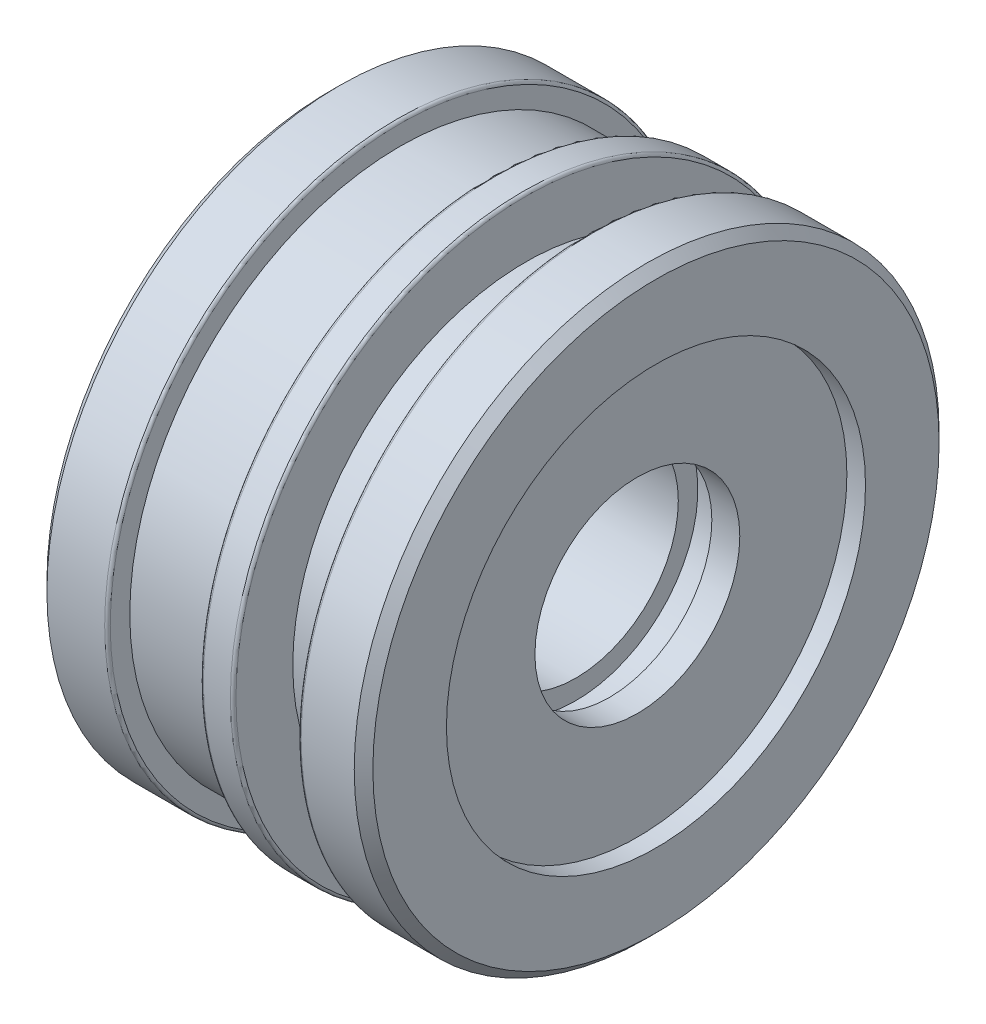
ISO-10303-21;
HEADER;
FILE_DESCRIPTION(('STEP AP214'),'2;1');
FILE_NAME('part.step','',(''),(''),'','','');
FILE_SCHEMA(('AUTOMOTIVE_DESIGN { 1 0 10303 214 1 1 1 1 }'));
ENDSEC;
DATA;
#1=APPLICATION_CONTEXT('core data for automotive mechanical design processes');
#2=APPLICATION_PROTOCOL_DEFINITION('international standard','automotive_design',2000,#1);
#3=PRODUCT_CONTEXT('',#1,'mechanical');
#4=PRODUCT('Part','Part','',(#3));
#5=PRODUCT_RELATED_PRODUCT_CATEGORY('part','',(#4));
#6=PRODUCT_DEFINITION_FORMATION('','',#4);
#7=PRODUCT_DEFINITION_CONTEXT('part definition',#1,'design');
#8=PRODUCT_DEFINITION('design','',#6,#7);
#9=PRODUCT_DEFINITION_SHAPE('','',#8);
#10=(LENGTH_UNIT() NAMED_UNIT(*) SI_UNIT(.MILLI.,.METRE.));
#11=(NAMED_UNIT(*) PLANE_ANGLE_UNIT() SI_UNIT($,.RADIAN.));
#12=(NAMED_UNIT(*) SI_UNIT($,.STERADIAN.) SOLID_ANGLE_UNIT());
#13=UNCERTAINTY_MEASURE_WITH_UNIT(LENGTH_MEASURE(1.E-05),#10,'distance_accuracy_value','');
#14=(GEOMETRIC_REPRESENTATION_CONTEXT(3) GLOBAL_UNCERTAINTY_ASSIGNED_CONTEXT((#13)) GLOBAL_UNIT_ASSIGNED_CONTEXT((#10,
#11,#12)) REPRESENTATION_CONTEXT('',''));
#15=CARTESIAN_POINT('',(0.,0.,0.));
#16=DIRECTION('',(0.,0.,1.));
#17=DIRECTION('',(1.,0.,0.));
#18=AXIS2_PLACEMENT_3D('',#15,#16,#17);
#19=CARTESIAN_POINT('',(0.,0.,0.));
#20=DIRECTION('',(-1.,0.,0.));
#21=DIRECTION('',(0.,0.,1.));
#22=AXIS2_PLACEMENT_3D('',#19,#20,#21);
#23=CYLINDRICAL_SURFACE('',#22,31.4);
#24=CARTESIAN_POINT('',(7.2,0.,0.));
#25=DIRECTION('',(-1.,0.,0.));
#26=DIRECTION('',(0.,0.,1.));
#27=AXIS2_PLACEMENT_3D('',#24,#25,#26);
#28=CIRCLE('',#27,31.4);
#29=CARTESIAN_POINT('',(7.2,0.,31.4));
#30=VERTEX_POINT('',#29);
#31=EDGE_CURVE('E35',#30,#30,#28,.T.);
#32=ORIENTED_EDGE('',*,*,#31,.T.);
#33=EDGE_LOOP('',(#32));
#34=FACE_BOUND('',#33,.T.);
#35=CARTESIAN_POINT('',(1.,0.,0.));
#36=DIRECTION('',(1.,0.,0.));
#37=DIRECTION('',(0.,0.,-1.));
#38=AXIS2_PLACEMENT_3D('',#35,#36,#37);
#39=CIRCLE('',#38,31.4);
#40=CARTESIAN_POINT('',(1.,0.,-31.4));
#41=VERTEX_POINT('',#40);
#42=EDGE_CURVE('E66',#41,#41,#39,.T.);
#43=ORIENTED_EDGE('',*,*,#42,.T.);
#44=EDGE_LOOP('',(#43));
#45=FACE_BOUND('',#44,.T.);
#46=ADVANCED_FACE('F29',(#34,#45),#23,.T.);
#47=CARTESIAN_POINT('',(7.5,31.4,0.));
#48=DIRECTION('',(-1.,0.,0.));
#49=DIRECTION('',(0.,0.,1.));
#50=AXIS2_PLACEMENT_3D('',#47,#48,#49);
#51=PLANE('',#50);
#52=CARTESIAN_POINT('',(7.5,0.,0.));
#53=DIRECTION('',(-1.,0.,0.));
#54=DIRECTION('',(0.,0.,1.));
#55=AXIS2_PLACEMENT_3D('',#52,#53,#54);
#56=CIRCLE('',#55,31.1);
#57=CARTESIAN_POINT('',(7.5,0.,31.1));
#58=VERTEX_POINT('',#57);
#59=EDGE_CURVE('E10',#58,#58,#56,.F.);
#60=ORIENTED_EDGE('',*,*,#59,.T.);
#61=EDGE_LOOP('',(#60));
#62=FACE_BOUND('',#61,.T.);
#63=CARTESIAN_POINT('',(7.5,0.,0.));
#64=DIRECTION('',(-1.,0.,0.));
#65=DIRECTION('',(0.,0.,1.));
#66=AXIS2_PLACEMENT_3D('',#63,#64,#65);
#67=CIRCLE('',#66,29.);
#68=CARTESIAN_POINT('',(7.5,0.,29.));
#69=VERTEX_POINT('',#68);
#70=EDGE_CURVE('E72',#69,#69,#67,.T.);
#71=ORIENTED_EDGE('',*,*,#70,.T.);
#72=EDGE_LOOP('',(#71));
#73=FACE_BOUND('',#72,.T.);
#74=ADVANCED_FACE('F133',(#62,#73),#51,.F.);
#75=CARTESIAN_POINT('',(0.,0.,0.));
#76=DIRECTION('',(-1.,0.,0.));
#77=DIRECTION('',(0.,0.,1.));
#78=AXIS2_PLACEMENT_3D('',#75,#76,#77);
#79=CYLINDRICAL_SURFACE('',#78,29.);
#80=ORIENTED_EDGE('',*,*,#70,.F.);
#81=EDGE_LOOP('',(#80));
#82=FACE_BOUND('',#81,.T.);
#83=CARTESIAN_POINT('',(17.5,0.,0.));
#84=DIRECTION('',(-1.,0.,0.));
#85=DIRECTION('',(0.,0.,1.));
#86=AXIS2_PLACEMENT_3D('',#83,#84,#85);
#87=CIRCLE('',#86,29.);
#88=CARTESIAN_POINT('',(17.5,0.,29.));
#89=VERTEX_POINT('',#88);
#90=EDGE_CURVE('E75',#89,#89,#87,.T.);
#91=ORIENTED_EDGE('',*,*,#90,.T.);
#92=EDGE_LOOP('',(#91));
#93=FACE_BOUND('',#92,.T.);
#94=ADVANCED_FACE('F137',(#82,#93),#79,.T.);
#95=CARTESIAN_POINT('',(17.5,29.,0.));
#96=DIRECTION('',(1.,0.,0.));
#97=DIRECTION('',(0.,0.,-1.));
#98=AXIS2_PLACEMENT_3D('',#95,#96,#97);
#99=PLANE('',#98);
#100=CARTESIAN_POINT('',(17.5,0.,0.));
#101=DIRECTION('',(1.,0.,0.));
#102=DIRECTION('',(0.,0.,-1.));
#103=AXIS2_PLACEMENT_3D('',#100,#101,#102);
#104=CIRCLE('',#103,31.1);
#105=CARTESIAN_POINT('',(17.5,0.,-31.1));
#106=VERTEX_POINT('',#105);
#107=EDGE_CURVE('E57',#106,#106,#104,.F.);
#108=ORIENTED_EDGE('',*,*,#107,.T.);
#109=EDGE_LOOP('',(#108));
#110=FACE_BOUND('',#109,.T.);
#111=ORIENTED_EDGE('',*,*,#90,.F.);
#112=EDGE_LOOP('',(#111));
#113=FACE_BOUND('',#112,.T.);
#114=ADVANCED_FACE('F145',(#110,#113),#99,.F.);
#115=CARTESIAN_POINT('',(0.,0.,0.));
#116=DIRECTION('',(-1.,0.,0.));
#117=DIRECTION('',(0.,0.,1.));
#118=AXIS2_PLACEMENT_3D('',#115,#116,#117);
#119=CYLINDRICAL_SURFACE('',#118,31.4);
#120=CARTESIAN_POINT('',(17.8,0.,0.));
#121=DIRECTION('',(1.,0.,0.));
#122=DIRECTION('',(0.,0.,-1.));
#123=AXIS2_PLACEMENT_3D('',#120,#121,#122);
#124=CIRCLE('',#123,31.4);
#125=CARTESIAN_POINT('',(17.8,0.,-31.4));
#126=VERTEX_POINT('',#125);
#127=EDGE_CURVE('E51',#126,#126,#124,.T.);
#128=ORIENTED_EDGE('',*,*,#127,.T.);
#129=EDGE_LOOP('',(#128));
#130=FACE_BOUND('',#129,.T.);
#131=CARTESIAN_POINT('',(20.7,0.,0.));
#132=DIRECTION('',(-1.,0.,0.));
#133=DIRECTION('',(0.,0.,1.));
#134=AXIS2_PLACEMENT_3D('',#131,#132,#133);
#135=CIRCLE('',#134,31.4);
#136=CARTESIAN_POINT('',(20.7,0.,31.4));
#137=VERTEX_POINT('',#136);
#138=EDGE_CURVE('E54',#137,#137,#135,.T.);
#139=ORIENTED_EDGE('',*,*,#138,.T.);
#140=EDGE_LOOP('',(#139));
#141=FACE_BOUND('',#140,.T.);
#142=ADVANCED_FACE('F152',(#130,#141),#119,.T.);
#143=CARTESIAN_POINT('',(21.,31.4,0.));
#144=DIRECTION('',(-1.,0.,0.));
#145=DIRECTION('',(0.,0.,1.));
#146=AXIS2_PLACEMENT_3D('',#143,#144,#145);
#147=PLANE('',#146);
#148=CARTESIAN_POINT('',(21.,0.,0.));
#149=DIRECTION('',(-1.,0.,0.));
#150=DIRECTION('',(0.,0.,1.));
#151=AXIS2_PLACEMENT_3D('',#148,#149,#150);
#152=CIRCLE('',#151,31.1);
#153=CARTESIAN_POINT('',(21.,0.,31.1));
#154=VERTEX_POINT('',#153);
#155=EDGE_CURVE('E39',#154,#154,#152,.F.);
#156=ORIENTED_EDGE('',*,*,#155,.T.);
#157=EDGE_LOOP('',(#156));
#158=FACE_BOUND('',#157,.T.);
#159=CARTESIAN_POINT('',(21.,0.,0.));
#160=DIRECTION('',(-1.,0.,0.));
#161=DIRECTION('',(0.,0.,1.));
#162=AXIS2_PLACEMENT_3D('',#159,#160,#161);
#163=CIRCLE('',#162,25.);
#164=CARTESIAN_POINT('',(21.,0.,25.));
#165=VERTEX_POINT('',#164);
#166=EDGE_CURVE('E78',#165,#165,#163,.T.);
#167=ORIENTED_EDGE('',*,*,#166,.T.);
#168=EDGE_LOOP('',(#167));
#169=FACE_BOUND('',#168,.T.);
#170=ADVANCED_FACE('F156',(#158,#169),#147,.F.);
#171=CARTESIAN_POINT('',(0.,0.,0.));
#172=DIRECTION('',(-1.,0.,0.));
#173=DIRECTION('',(0.,0.,1.));
#174=AXIS2_PLACEMENT_3D('',#171,#172,#173);
#175=CYLINDRICAL_SURFACE('',#174,25.);
#176=ORIENTED_EDGE('',*,*,#166,.F.);
#177=EDGE_LOOP('',(#176));
#178=FACE_BOUND('',#177,.T.);
#179=CARTESIAN_POINT('',(28.,0.,0.));
#180=DIRECTION('',(-1.,0.,0.));
#181=DIRECTION('',(0.,0.,1.));
#182=AXIS2_PLACEMENT_3D('',#179,#180,#181);
#183=CIRCLE('',#182,25.);
#184=CARTESIAN_POINT('',(28.,0.,25.));
#185=VERTEX_POINT('',#184);
#186=EDGE_CURVE('E81',#185,#185,#183,.T.);
#187=ORIENTED_EDGE('',*,*,#186,.T.);
#188=EDGE_LOOP('',(#187));
#189=FACE_BOUND('',#188,.T.);
#190=ADVANCED_FACE('F160',(#178,#189),#175,.T.);
#191=CARTESIAN_POINT('',(28.,25.,0.));
#192=DIRECTION('',(1.,0.,0.));
#193=DIRECTION('',(0.,0.,-1.));
#194=AXIS2_PLACEMENT_3D('',#191,#192,#193);
#195=PLANE('',#194);
#196=CARTESIAN_POINT('',(28.,0.,0.));
#197=DIRECTION('',(1.,0.,0.));
#198=DIRECTION('',(0.,0.,-1.));
#199=AXIS2_PLACEMENT_3D('',#196,#197,#198);
#200=CIRCLE('',#199,31.1);
#201=CARTESIAN_POINT('',(28.,0.,-31.1));
#202=VERTEX_POINT('',#201);
#203=EDGE_CURVE('E48',#202,#202,#200,.F.);
#204=ORIENTED_EDGE('',*,*,#203,.T.);
#205=EDGE_LOOP('',(#204));
#206=FACE_BOUND('',#205,.T.);
#207=ORIENTED_EDGE('',*,*,#186,.F.);
#208=EDGE_LOOP('',(#207));
#209=FACE_BOUND('',#208,.T.);
#210=ADVANCED_FACE('F164',(#206,#209),#195,.F.);
#211=CARTESIAN_POINT('',(0.,0.,0.));
#212=DIRECTION('',(-1.,0.,0.));
#213=DIRECTION('',(0.,0.,1.));
#214=AXIS2_PLACEMENT_3D('',#211,#212,#213);
#215=CYLINDRICAL_SURFACE('',#214,31.4);
#216=CARTESIAN_POINT('',(28.3,0.,0.));
#217=DIRECTION('',(1.,0.,0.));
#218=DIRECTION('',(0.,0.,-1.));
#219=AXIS2_PLACEMENT_3D('',#216,#217,#218);
#220=CIRCLE('',#219,31.4);
#221=CARTESIAN_POINT('',(28.3,0.,-31.4));
#222=VERTEX_POINT('',#221);
#223=EDGE_CURVE('E43',#222,#222,#220,.T.);
#224=ORIENTED_EDGE('',*,*,#223,.T.);
#225=EDGE_LOOP('',(#224));
#226=FACE_BOUND('',#225,.T.);
#227=CARTESIAN_POINT('',(34.,0.,0.));
#228=DIRECTION('',(-1.,0.,0.));
#229=DIRECTION('',(0.,0.,1.));
#230=AXIS2_PLACEMENT_3D('',#227,#228,#229);
#231=CIRCLE('',#230,31.4);
#232=CARTESIAN_POINT('',(34.,0.,31.4));
#233=VERTEX_POINT('',#232);
#234=EDGE_CURVE('E63',#233,#233,#231,.T.);
#235=ORIENTED_EDGE('',*,*,#234,.T.);
#236=EDGE_LOOP('',(#235));
#237=FACE_BOUND('',#236,.T.);
#238=ADVANCED_FACE('F168',(#226,#237),#215,.T.);
#239=CARTESIAN_POINT('',(35.,31.4,0.));
#240=DIRECTION('',(-1.,0.,0.));
#241=DIRECTION('',(0.,0.,1.));
#242=AXIS2_PLACEMENT_3D('',#239,#240,#241);
#243=PLANE('',#242);
#244=CARTESIAN_POINT('',(35.,0.,0.));
#245=DIRECTION('',(-1.,0.,0.));
#246=DIRECTION('',(0.,0.,1.));
#247=AXIS2_PLACEMENT_3D('',#244,#245,#246);
#248=CIRCLE('',#247,30.4);
#249=CARTESIAN_POINT('',(35.,0.,30.4));
#250=VERTEX_POINT('',#249);
#251=EDGE_CURVE('E60',#250,#250,#248,.F.);
#252=ORIENTED_EDGE('',*,*,#251,.T.);
#253=EDGE_LOOP('',(#252));
#254=FACE_BOUND('',#253,.T.);
#255=CARTESIAN_POINT('',(35.,0.,0.));
#256=DIRECTION('',(-1.,0.,0.));
#257=DIRECTION('',(0.,0.,1.));
#258=AXIS2_PLACEMENT_3D('',#255,#256,#257);
#259=CIRCLE('',#258,22.5);
#260=CARTESIAN_POINT('',(35.,0.,22.5));
#261=VERTEX_POINT('',#260);
#262=EDGE_CURVE('E84',#261,#261,#259,.T.);
#263=ORIENTED_EDGE('',*,*,#262,.T.);
#264=EDGE_LOOP('',(#263));
#265=FACE_BOUND('',#264,.T.);
#266=ADVANCED_FACE('F172',(#254,#265),#243,.F.);
#267=CARTESIAN_POINT('',(0.,0.,0.));
#268=DIRECTION('',(-1.,0.,0.));
#269=DIRECTION('',(0.,0.,1.));
#270=AXIS2_PLACEMENT_3D('',#267,#268,#269);
#271=CYLINDRICAL_SURFACE('',#270,22.5);
#272=ORIENTED_EDGE('',*,*,#262,.F.);
#273=EDGE_LOOP('',(#272));
#274=FACE_BOUND('',#273,.T.);
#275=CARTESIAN_POINT('',(33.,0.,0.));
#276=DIRECTION('',(-1.,0.,0.));
#277=DIRECTION('',(0.,0.,1.));
#278=AXIS2_PLACEMENT_3D('',#275,#276,#277);
#279=CIRCLE('',#278,22.5);
#280=CARTESIAN_POINT('',(33.,0.,22.5));
#281=VERTEX_POINT('',#280);
#282=EDGE_CURVE('E87',#281,#281,#279,.T.);
#283=ORIENTED_EDGE('',*,*,#282,.T.);
#284=EDGE_LOOP('',(#283));
#285=FACE_BOUND('',#284,.T.);
#286=ADVANCED_FACE('F176',(#274,#285),#271,.F.);
#287=CARTESIAN_POINT('',(33.,22.5,0.));
#288=DIRECTION('',(-1.,0.,0.));
#289=DIRECTION('',(0.,0.,1.));
#290=AXIS2_PLACEMENT_3D('',#287,#288,#289);
#291=PLANE('',#290);
#292=ORIENTED_EDGE('',*,*,#282,.F.);
#293=EDGE_LOOP('',(#292));
#294=FACE_BOUND('',#293,.T.);
#295=CARTESIAN_POINT('',(33.,0.,0.));
#296=DIRECTION('',(-1.,0.,0.));
#297=DIRECTION('',(0.,0.,1.));
#298=AXIS2_PLACEMENT_3D('',#295,#296,#297);
#299=CIRCLE('',#298,11.);
#300=CARTESIAN_POINT('',(33.,0.,11.));
#301=VERTEX_POINT('',#300);
#302=EDGE_CURVE('E90',#301,#301,#299,.T.);
#303=ORIENTED_EDGE('',*,*,#302,.T.);
#304=EDGE_LOOP('',(#303));
#305=FACE_BOUND('',#304,.T.);
#306=ADVANCED_FACE('F180',(#294,#305),#291,.F.);
#307=CARTESIAN_POINT('',(0.,0.,0.));
#308=DIRECTION('',(-1.,0.,0.));
#309=DIRECTION('',(0.,0.,1.));
#310=AXIS2_PLACEMENT_3D('',#307,#308,#309);
#311=CYLINDRICAL_SURFACE('',#310,11.);
#312=ORIENTED_EDGE('',*,*,#302,.F.);
#313=EDGE_LOOP('',(#312));
#314=FACE_BOUND('',#313,.T.);
#315=CARTESIAN_POINT('',(30.,0.,0.));
#316=DIRECTION('',(-1.,0.,0.));
#317=DIRECTION('',(0.,0.,1.));
#318=AXIS2_PLACEMENT_3D('',#315,#316,#317);
#319=CIRCLE('',#318,11.);
#320=CARTESIAN_POINT('',(30.,0.,11.));
#321=VERTEX_POINT('',#320);
#322=EDGE_CURVE('E93',#321,#321,#319,.T.);
#323=ORIENTED_EDGE('',*,*,#322,.T.);
#324=EDGE_LOOP('',(#323));
#325=FACE_BOUND('',#324,.T.);
#326=ADVANCED_FACE('F184',(#314,#325),#311,.F.);
#327=CARTESIAN_POINT('',(30.,11.,0.));
#328=DIRECTION('',(1.,0.,0.));
#329=DIRECTION('',(0.,0.,-1.));
#330=AXIS2_PLACEMENT_3D('',#327,#328,#329);
#331=PLANE('',#330);
#332=ORIENTED_EDGE('',*,*,#322,.F.);
#333=EDGE_LOOP('',(#332));
#334=FACE_BOUND('',#333,.T.);
#335=CARTESIAN_POINT('',(30.,0.,0.));
#336=DIRECTION('',(-1.,0.,0.));
#337=DIRECTION('',(0.,0.,1.));
#338=AXIS2_PLACEMENT_3D('',#335,#336,#337);
#339=CIRCLE('',#338,13.1);
#340=CARTESIAN_POINT('',(30.,0.,13.1));
#341=VERTEX_POINT('',#340);
#342=EDGE_CURVE('E96',#341,#341,#339,.T.);
#343=ORIENTED_EDGE('',*,*,#342,.T.);
#344=EDGE_LOOP('',(#343));
#345=FACE_BOUND('',#344,.T.);
#346=ADVANCED_FACE('F188',(#334,#345),#331,.F.);
#347=CARTESIAN_POINT('',(0.,0.,0.));
#348=DIRECTION('',(-1.,0.,0.));
#349=DIRECTION('',(0.,0.,1.));
#350=AXIS2_PLACEMENT_3D('',#347,#348,#349);
#351=CYLINDRICAL_SURFACE('',#350,13.1);
#352=ORIENTED_EDGE('',*,*,#342,.F.);
#353=EDGE_LOOP('',(#352));
#354=FACE_BOUND('',#353,.T.);
#355=CARTESIAN_POINT('',(26.4,0.,0.));
#356=DIRECTION('',(-1.,0.,0.));
#357=DIRECTION('',(0.,0.,1.));
#358=AXIS2_PLACEMENT_3D('',#355,#356,#357);
#359=CIRCLE('',#358,13.1);
#360=CARTESIAN_POINT('',(26.4,0.,13.1));
#361=VERTEX_POINT('',#360);
#362=EDGE_CURVE('E99',#361,#361,#359,.T.);
#363=ORIENTED_EDGE('',*,*,#362,.T.);
#364=EDGE_LOOP('',(#363));
#365=FACE_BOUND('',#364,.T.);
#366=ADVANCED_FACE('F192',(#354,#365),#351,.F.);
#367=CARTESIAN_POINT('',(26.4,13.1,0.));
#368=DIRECTION('',(-1.,0.,0.));
#369=DIRECTION('',(0.,0.,1.));
#370=AXIS2_PLACEMENT_3D('',#367,#368,#369);
#371=PLANE('',#370);
#372=ORIENTED_EDGE('',*,*,#362,.F.);
#373=EDGE_LOOP('',(#372));
#374=FACE_BOUND('',#373,.T.);
#375=CARTESIAN_POINT('',(26.4,0.,0.));
#376=DIRECTION('',(-1.,0.,0.));
#377=DIRECTION('',(0.,0.,1.));
#378=AXIS2_PLACEMENT_3D('',#375,#376,#377);
#379=CIRCLE('',#378,11.);
#380=CARTESIAN_POINT('',(26.4,0.,11.));
#381=VERTEX_POINT('',#380);
#382=EDGE_CURVE('E102',#381,#381,#379,.T.);
#383=ORIENTED_EDGE('',*,*,#382,.T.);
#384=EDGE_LOOP('',(#383));
#385=FACE_BOUND('',#384,.T.);
#386=ADVANCED_FACE('F196',(#374,#385),#371,.F.);
#387=CARTESIAN_POINT('',(0.,0.,0.));
#388=DIRECTION('',(-1.,0.,0.));
#389=DIRECTION('',(0.,0.,1.));
#390=AXIS2_PLACEMENT_3D('',#387,#388,#389);
#391=CYLINDRICAL_SURFACE('',#390,11.);
#392=ORIENTED_EDGE('',*,*,#382,.F.);
#393=EDGE_LOOP('',(#392));
#394=FACE_BOUND('',#393,.T.);
#395=CARTESIAN_POINT('',(6.5,0.,0.));
#396=DIRECTION('',(-1.,0.,0.));
#397=DIRECTION('',(0.,0.,1.));
#398=AXIS2_PLACEMENT_3D('',#395,#396,#397);
#399=CIRCLE('',#398,11.);
#400=CARTESIAN_POINT('',(6.5,0.,11.));
#401=VERTEX_POINT('',#400);
#402=EDGE_CURVE('E105',#401,#401,#399,.T.);
#403=ORIENTED_EDGE('',*,*,#402,.T.);
#404=EDGE_LOOP('',(#403));
#405=FACE_BOUND('',#404,.T.);
#406=ADVANCED_FACE('F200',(#394,#405),#391,.F.);
#407=CARTESIAN_POINT('',(6.5,11.,0.));
#408=DIRECTION('',(1.,0.,0.));
#409=DIRECTION('',(0.,0.,-1.));
#410=AXIS2_PLACEMENT_3D('',#407,#408,#409);
#411=PLANE('',#410);
#412=ORIENTED_EDGE('',*,*,#402,.F.);
#413=EDGE_LOOP('',(#412));
#414=FACE_BOUND('',#413,.T.);
#415=CARTESIAN_POINT('',(6.5,0.,0.));
#416=DIRECTION('',(-1.,0.,0.));
#417=DIRECTION('',(0.,0.,1.));
#418=AXIS2_PLACEMENT_3D('',#415,#416,#417);
#419=CIRCLE('',#418,15.);
#420=CARTESIAN_POINT('',(6.5,0.,15.));
#421=VERTEX_POINT('',#420);
#422=EDGE_CURVE('E108',#421,#421,#419,.T.);
#423=ORIENTED_EDGE('',*,*,#422,.T.);
#424=EDGE_LOOP('',(#423));
#425=FACE_BOUND('',#424,.T.);
#426=ADVANCED_FACE('F129',(#414,#425),#411,.F.);
#427=CARTESIAN_POINT('',(0.,0.,0.));
#428=DIRECTION('',(-1.,0.,0.));
#429=DIRECTION('',(0.,0.,1.));
#430=AXIS2_PLACEMENT_3D('',#427,#428,#429);
#431=CYLINDRICAL_SURFACE('',#430,15.);
#432=ORIENTED_EDGE('',*,*,#422,.F.);
#433=EDGE_LOOP('',(#432));
#434=FACE_BOUND('',#433,.T.);
#435=CARTESIAN_POINT('',(0.,0.,0.));
#436=DIRECTION('',(-1.,0.,0.));
#437=DIRECTION('',(0.,0.,1.));
#438=AXIS2_PLACEMENT_3D('',#435,#436,#437);
#439=CIRCLE('',#438,15.);
#440=CARTESIAN_POINT('',(0.,0.,15.));
#441=VERTEX_POINT('',#440);
#442=EDGE_CURVE('E111',#441,#441,#439,.T.);
#443=ORIENTED_EDGE('',*,*,#442,.T.);
#444=EDGE_LOOP('',(#443));
#445=FACE_BOUND('',#444,.T.);
#446=ADVANCED_FACE('F115',(#434,#445),#431,.F.);
#447=CARTESIAN_POINT('',(0.,15.,0.));
#448=DIRECTION('',(1.,0.,0.));
#449=DIRECTION('',(0.,0.,-1.));
#450=AXIS2_PLACEMENT_3D('',#447,#448,#449);
#451=PLANE('',#450);
#452=CARTESIAN_POINT('',(0.,0.,0.));
#453=DIRECTION('',(1.,0.,0.));
#454=DIRECTION('',(0.,0.,-1.));
#455=AXIS2_PLACEMENT_3D('',#452,#453,#454);
#456=CIRCLE('',#455,30.4);
#457=CARTESIAN_POINT('',(0.,0.,-30.4));
#458=VERTEX_POINT('',#457);
#459=EDGE_CURVE('E69',#458,#458,#456,.F.);
#460=ORIENTED_EDGE('',*,*,#459,.T.);
#461=EDGE_LOOP('',(#460));
#462=FACE_BOUND('',#461,.T.);
#463=ORIENTED_EDGE('',*,*,#442,.F.);
#464=EDGE_LOOP('',(#463));
#465=FACE_BOUND('',#464,.T.);
#466=ADVANCED_FACE('F117',(#462,#465),#451,.F.);
#467=CARTESIAN_POINT('',(0.,0.,0.));
#468=DIRECTION('',(1.,0.,0.));
#469=DIRECTION('',(0.,0.,-1.));
#470=AXIS2_PLACEMENT_3D('',#467,#468,#469);
#471=CONICAL_SURFACE('',#470,30.4,0.785398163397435);
#472=ORIENTED_EDGE('',*,*,#42,.F.);
#473=EDGE_LOOP('',(#472));
#474=FACE_BOUND('',#473,.T.);
#475=ORIENTED_EDGE('',*,*,#459,.F.);
#476=EDGE_LOOP('',(#475));
#477=FACE_BOUND('',#476,.T.);
#478=ADVANCED_FACE('F119',(#474,#477),#471,.T.);
#479=CARTESIAN_POINT('',(34.,0.,0.));
#480=DIRECTION('',(-1.,0.,0.));
#481=DIRECTION('',(0.,0.,1.));
#482=AXIS2_PLACEMENT_3D('',#479,#480,#481);
#483=CONICAL_SURFACE('',#482,31.4,0.785398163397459);
#484=ORIENTED_EDGE('',*,*,#251,.F.);
#485=EDGE_LOOP('',(#484));
#486=FACE_BOUND('',#485,.T.);
#487=ORIENTED_EDGE('',*,*,#234,.F.);
#488=EDGE_LOOP('',(#487));
#489=FACE_BOUND('',#488,.T.);
#490=ADVANCED_FACE('F126',(#486,#489),#483,.T.);
#491=CARTESIAN_POINT('',(17.8,0.,0.));
#492=DIRECTION('',(1.,0.,0.));
#493=DIRECTION('',(0.,0.,-1.));
#494=AXIS2_PLACEMENT_3D('',#491,#492,#493);
#495=TOROIDAL_SURFACE('',#494,31.1,0.3);
#496=ORIENTED_EDGE('',*,*,#127,.F.);
#497=EDGE_LOOP('',(#496));
#498=FACE_BOUND('',#497,.T.);
#499=ORIENTED_EDGE('',*,*,#107,.F.);
#500=EDGE_LOOP('',(#499));
#501=FACE_BOUND('',#500,.T.);
#502=ADVANCED_FACE('F245',(#498,#501),#495,.T.);
#503=CARTESIAN_POINT('',(28.3,0.,0.));
#504=DIRECTION('',(1.,0.,0.));
#505=DIRECTION('',(0.,0.,-1.));
#506=AXIS2_PLACEMENT_3D('',#503,#504,#505);
#507=TOROIDAL_SURFACE('',#506,31.1,0.3);
#508=ORIENTED_EDGE('',*,*,#223,.F.);
#509=EDGE_LOOP('',(#508));
#510=FACE_BOUND('',#509,.T.);
#511=ORIENTED_EDGE('',*,*,#203,.F.);
#512=EDGE_LOOP('',(#511));
#513=FACE_BOUND('',#512,.T.);
#514=ADVANCED_FACE('F295',(#510,#513),#507,.T.);
#515=CARTESIAN_POINT('',(20.7,0.,0.));
#516=DIRECTION('',(-1.,0.,0.));
#517=DIRECTION('',(0.,0.,1.));
#518=AXIS2_PLACEMENT_3D('',#515,#516,#517);
#519=TOROIDAL_SURFACE('',#518,31.1,0.3);
#520=ORIENTED_EDGE('',*,*,#155,.F.);
#521=EDGE_LOOP('',(#520));
#522=FACE_BOUND('',#521,.T.);
#523=ORIENTED_EDGE('',*,*,#138,.F.);
#524=EDGE_LOOP('',(#523));
#525=FACE_BOUND('',#524,.T.);
#526=ADVANCED_FACE('F305',(#522,#525),#519,.T.);
#527=CARTESIAN_POINT('',(7.2,0.,0.));
#528=DIRECTION('',(-1.,0.,0.));
#529=DIRECTION('',(0.,0.,1.));
#530=AXIS2_PLACEMENT_3D('',#527,#528,#529);
#531=TOROIDAL_SURFACE('',#530,31.1,0.3);
#532=ORIENTED_EDGE('',*,*,#59,.F.);
#533=EDGE_LOOP('',(#532));
#534=FACE_BOUND('',#533,.T.);
#535=ORIENTED_EDGE('',*,*,#31,.F.);
#536=EDGE_LOOP('',(#535));
#537=FACE_BOUND('',#536,.T.);
#538=ADVANCED_FACE('F315',(#534,#537),#531,.T.);
#539=CLOSED_SHELL('',(#46,#74,#94,#114,#142,#170,#190,#210,#238,#266,#286,#306,#326,#346,#366,
#386,#406,#426,#446,#466,#478,#490,#502,#514,#526,#538));
#540=MANIFOLD_SOLID_BREP('B2',#539);
#541=ADVANCED_BREP_SHAPE_REPRESENTATION('',(#18,#540),#14);
#542=SHAPE_DEFINITION_REPRESENTATION(#9,#541);
ENDSEC;
END-ISO-10303-21;
